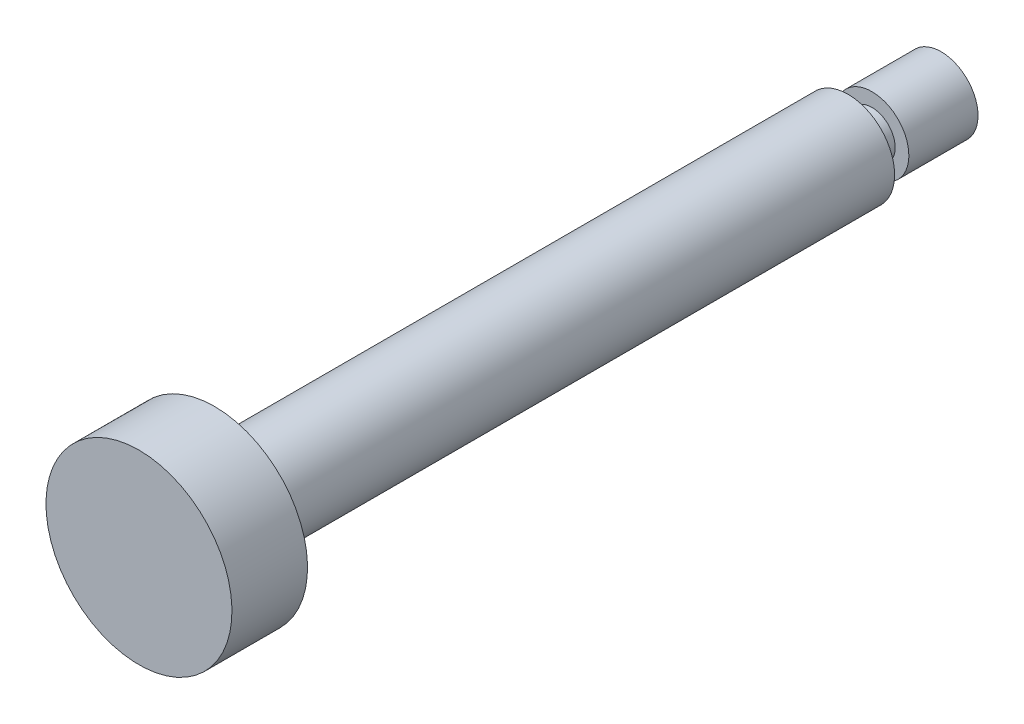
ISO-10303-21;
HEADER;
FILE_DESCRIPTION(('STEP AP214'),'2;1');
FILE_NAME('part.step','',(''),(''),'','','');
FILE_SCHEMA(('AUTOMOTIVE_DESIGN { 1 0 10303 214 1 1 1 1 }'));
ENDSEC;
DATA;
#1=APPLICATION_CONTEXT('core data for automotive mechanical design processes');
#2=APPLICATION_PROTOCOL_DEFINITION('international standard','automotive_design',2000,#1);
#3=PRODUCT_CONTEXT('',#1,'mechanical');
#4=PRODUCT('Part','Part','',(#3));
#5=PRODUCT_RELATED_PRODUCT_CATEGORY('part','',(#4));
#6=PRODUCT_DEFINITION_FORMATION('','',#4);
#7=PRODUCT_DEFINITION_CONTEXT('part definition',#1,'design');
#8=PRODUCT_DEFINITION('design','',#6,#7);
#9=PRODUCT_DEFINITION_SHAPE('','',#8);
#10=(LENGTH_UNIT() NAMED_UNIT(*) SI_UNIT(.MILLI.,.METRE.));
#11=(NAMED_UNIT(*) PLANE_ANGLE_UNIT() SI_UNIT($,.RADIAN.));
#12=(NAMED_UNIT(*) SI_UNIT($,.STERADIAN.) SOLID_ANGLE_UNIT());
#13=UNCERTAINTY_MEASURE_WITH_UNIT(LENGTH_MEASURE(1.E-05),#10,'distance_accuracy_value','');
#14=(GEOMETRIC_REPRESENTATION_CONTEXT(3) GLOBAL_UNCERTAINTY_ASSIGNED_CONTEXT((#13)) GLOBAL_UNIT_ASSIGNED_CONTEXT((#10,
#11,#12)) REPRESENTATION_CONTEXT('',''));
#15=CARTESIAN_POINT('',(0.,0.,0.));
#16=DIRECTION('',(0.,0.,1.));
#17=DIRECTION('',(1.,0.,0.));
#18=AXIS2_PLACEMENT_3D('',#15,#16,#17);
#19=CARTESIAN_POINT('',(0.,-8.,16.));
#20=DIRECTION('',(0.,0.,-1.));
#21=DIRECTION('',(0.,-1.,0.));
#22=AXIS2_PLACEMENT_3D('',#19,#20,#21);
#23=PLANE('',#22);
#24=CARTESIAN_POINT('',(0.,0.,16.));
#25=DIRECTION('',(0.,0.,1.));
#26=DIRECTION('',(0.,1.,0.));
#27=AXIS2_PLACEMENT_3D('',#24,#25,#26);
#28=CIRCLE('',#27,4.);
#29=CARTESIAN_POINT('',(0.,4.,16.));
#30=VERTEX_POINT('',#29);
#31=EDGE_CURVE('E40',#30,#30,#28,.T.);
#32=ORIENTED_EDGE('',*,*,#31,.T.);
#33=EDGE_LOOP('',(#32));
#34=FACE_BOUND('',#33,.T.);
#35=CARTESIAN_POINT('',(0.,0.,16.));
#36=DIRECTION('',(0.,0.,1.));
#37=DIRECTION('',(0.,1.,0.));
#38=AXIS2_PLACEMENT_3D('',#35,#36,#37);
#39=CIRCLE('',#38,8.);
#40=CARTESIAN_POINT('',(0.,8.,16.));
#41=VERTEX_POINT('',#40);
#42=EDGE_CURVE('E8',#41,#41,#39,.T.);
#43=ORIENTED_EDGE('',*,*,#42,.F.);
#44=EDGE_LOOP('',(#43));
#45=FACE_BOUND('',#44,.T.);
#46=ADVANCED_FACE('F12',(#34,#45),#23,.T.);
#47=CARTESIAN_POINT('',(0.,0.,20.));
#48=DIRECTION('',(0.,0.,1.));
#49=DIRECTION('',(0.,1.,0.));
#50=AXIS2_PLACEMENT_3D('',#47,#48,#49);
#51=CYLINDRICAL_SURFACE('',#50,8.);
#52=CARTESIAN_POINT('',(0.,0.,125.));
#53=DIRECTION('',(0.,0.,1.));
#54=DIRECTION('',(0.,1.,0.));
#55=AXIS2_PLACEMENT_3D('',#52,#53,#54);
#56=CIRCLE('',#55,8.);
#57=CARTESIAN_POINT('',(0.,8.,125.));
#58=VERTEX_POINT('',#57);
#59=EDGE_CURVE('E18',#58,#58,#56,.T.);
#60=ORIENTED_EDGE('',*,*,#59,.F.);
#61=EDGE_LOOP('',(#60));
#62=FACE_BOUND('',#61,.T.);
#63=ORIENTED_EDGE('',*,*,#42,.T.);
#64=EDGE_LOOP('',(#63));
#65=FACE_BOUND('',#64,.T.);
#66=ADVANCED_FACE('F59',(#62,#65),#51,.T.);
#67=CARTESIAN_POINT('',(0.,-16.,125.));
#68=DIRECTION('',(0.,0.,-1.));
#69=DIRECTION('',(0.,-1.,0.));
#70=AXIS2_PLACEMENT_3D('',#67,#68,#69);
#71=PLANE('',#70);
#72=ORIENTED_EDGE('',*,*,#59,.T.);
#73=EDGE_LOOP('',(#72));
#74=FACE_BOUND('',#73,.T.);
#75=CARTESIAN_POINT('',(0.,0.,125.));
#76=DIRECTION('',(0.,0.,1.));
#77=DIRECTION('',(0.,1.,0.));
#78=AXIS2_PLACEMENT_3D('',#75,#76,#77);
#79=CIRCLE('',#78,16.);
#80=CARTESIAN_POINT('',(0.,16.,125.));
#81=VERTEX_POINT('',#80);
#82=EDGE_CURVE('E22',#81,#81,#79,.T.);
#83=ORIENTED_EDGE('',*,*,#82,.F.);
#84=EDGE_LOOP('',(#83));
#85=FACE_BOUND('',#84,.T.);
#86=ADVANCED_FACE('F63',(#74,#85),#71,.T.);
#87=CARTESIAN_POINT('',(0.,0.,20.));
#88=DIRECTION('',(0.,0.,1.));
#89=DIRECTION('',(0.,1.,0.));
#90=AXIS2_PLACEMENT_3D('',#87,#88,#89);
#91=CYLINDRICAL_SURFACE('',#90,16.);
#92=CARTESIAN_POINT('',(0.,0.,138.));
#93=DIRECTION('',(0.,0.,1.));
#94=DIRECTION('',(0.,1.,0.));
#95=AXIS2_PLACEMENT_3D('',#92,#93,#94);
#96=CIRCLE('',#95,16.);
#97=CARTESIAN_POINT('',(0.,16.,138.));
#98=VERTEX_POINT('',#97);
#99=EDGE_CURVE('E26',#98,#98,#96,.T.);
#100=ORIENTED_EDGE('',*,*,#99,.F.);
#101=EDGE_LOOP('',(#100));
#102=FACE_BOUND('',#101,.T.);
#103=ORIENTED_EDGE('',*,*,#82,.T.);
#104=EDGE_LOOP('',(#103));
#105=FACE_BOUND('',#104,.T.);
#106=ADVANCED_FACE('F68',(#102,#105),#91,.T.);
#107=CARTESIAN_POINT('',(0.,-16.,138.));
#108=DIRECTION('',(0.,0.,-1.));
#109=DIRECTION('',(0.,-1.,0.));
#110=AXIS2_PLACEMENT_3D('',#107,#108,#109);
#111=PLANE('',#110);
#112=ORIENTED_EDGE('',*,*,#99,.T.);
#113=EDGE_LOOP('',(#112));
#114=FACE_BOUND('',#113,.T.);
#115=ADVANCED_FACE('F73',(#114),#111,.F.);
#116=CARTESIAN_POINT('',(0.,-6.35,0.));
#117=DIRECTION('',(0.,0.,-1.));
#118=DIRECTION('',(0.,-1.,0.));
#119=AXIS2_PLACEMENT_3D('',#116,#117,#118);
#120=PLANE('',#119);
#121=CARTESIAN_POINT('',(0.,0.,0.));
#122=DIRECTION('',(0.,0.,1.));
#123=DIRECTION('',(0.,1.,0.));
#124=AXIS2_PLACEMENT_3D('',#121,#122,#123);
#125=CIRCLE('',#124,6.35);
#126=CARTESIAN_POINT('',(0.,6.35,0.));
#127=VERTEX_POINT('',#126);
#128=EDGE_CURVE('E31',#127,#127,#125,.T.);
#129=ORIENTED_EDGE('',*,*,#128,.F.);
#130=EDGE_LOOP('',(#129));
#131=FACE_BOUND('',#130,.T.);
#132=ADVANCED_FACE('F77',(#131),#120,.T.);
#133=CARTESIAN_POINT('',(0.,0.,20.));
#134=DIRECTION('',(0.,0.,1.));
#135=DIRECTION('',(0.,1.,0.));
#136=AXIS2_PLACEMENT_3D('',#133,#134,#135);
#137=CYLINDRICAL_SURFACE('',#136,6.35);
#138=ORIENTED_EDGE('',*,*,#128,.T.);
#139=EDGE_LOOP('',(#138));
#140=FACE_BOUND('',#139,.T.);
#141=CARTESIAN_POINT('',(0.,0.,11.9));
#142=DIRECTION('',(0.,0.,1.));
#143=DIRECTION('',(0.,1.,0.));
#144=AXIS2_PLACEMENT_3D('',#141,#142,#143);
#145=CIRCLE('',#144,6.35);
#146=CARTESIAN_POINT('',(0.,6.35,11.9));
#147=VERTEX_POINT('',#146);
#148=EDGE_CURVE('E34',#147,#147,#145,.T.);
#149=ORIENTED_EDGE('',*,*,#148,.F.);
#150=EDGE_LOOP('',(#149));
#151=FACE_BOUND('',#150,.T.);
#152=ADVANCED_FACE('F55',(#140,#151),#137,.T.);
#153=CARTESIAN_POINT('',(0.,-4.,11.9));
#154=DIRECTION('',(0.,0.,1.));
#155=DIRECTION('',(0.,1.,0.));
#156=AXIS2_PLACEMENT_3D('',#153,#154,#155);
#157=PLANE('',#156);
#158=ORIENTED_EDGE('',*,*,#148,.T.);
#159=EDGE_LOOP('',(#158));
#160=FACE_BOUND('',#159,.T.);
#161=CARTESIAN_POINT('',(0.,0.,11.9));
#162=DIRECTION('',(0.,0.,1.));
#163=DIRECTION('',(0.,1.,0.));
#164=AXIS2_PLACEMENT_3D('',#161,#162,#163);
#165=CIRCLE('',#164,4.);
#166=CARTESIAN_POINT('',(0.,4.,11.9));
#167=VERTEX_POINT('',#166);
#168=EDGE_CURVE('E37',#167,#167,#165,.T.);
#169=ORIENTED_EDGE('',*,*,#168,.F.);
#170=EDGE_LOOP('',(#169));
#171=FACE_BOUND('',#170,.T.);
#172=ADVANCED_FACE('F48',(#160,#171),#157,.T.);
#173=CARTESIAN_POINT('',(0.,0.,20.));
#174=DIRECTION('',(0.,0.,1.));
#175=DIRECTION('',(0.,1.,0.));
#176=AXIS2_PLACEMENT_3D('',#173,#174,#175);
#177=CYLINDRICAL_SURFACE('',#176,4.);
#178=ORIENTED_EDGE('',*,*,#168,.T.);
#179=EDGE_LOOP('',(#178));
#180=FACE_BOUND('',#179,.T.);
#181=ORIENTED_EDGE('',*,*,#31,.F.);
#182=EDGE_LOOP('',(#181));
#183=FACE_BOUND('',#182,.T.);
#184=ADVANCED_FACE('F46',(#180,#183),#177,.T.);
#185=CLOSED_SHELL('',(#46,#66,#86,#106,#115,#132,#152,#172,#184));
#186=MANIFOLD_SOLID_BREP('B1',#185);
#187=ADVANCED_BREP_SHAPE_REPRESENTATION('',(#18,#186),#14);
#188=SHAPE_DEFINITION_REPRESENTATION(#9,#187);
ENDSEC;
END-ISO-10303-21;
